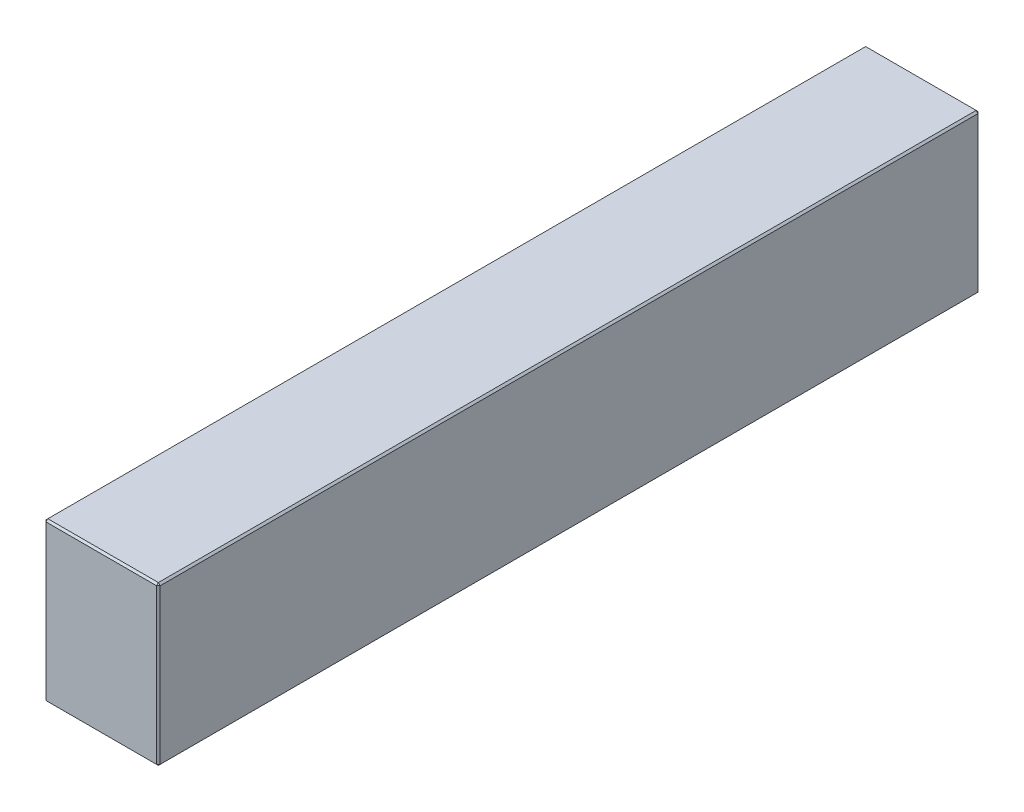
ISO-10303-21;
HEADER;
FILE_DESCRIPTION(('STEP AP214'),'2;1');
FILE_NAME('part.step','',(''),(''),'','','');
FILE_SCHEMA(('AUTOMOTIVE_DESIGN { 1 0 10303 214 1 1 1 1 }'));
ENDSEC;
DATA;
#1=APPLICATION_CONTEXT('core data for automotive mechanical design processes');
#2=APPLICATION_PROTOCOL_DEFINITION('international standard','automotive_design',2000,#1);
#3=PRODUCT_CONTEXT('',#1,'mechanical');
#4=PRODUCT('Part','Part','',(#3));
#5=PRODUCT_RELATED_PRODUCT_CATEGORY('part','',(#4));
#6=PRODUCT_DEFINITION_FORMATION('','',#4);
#7=PRODUCT_DEFINITION_CONTEXT('part definition',#1,'design');
#8=PRODUCT_DEFINITION('design','',#6,#7);
#9=PRODUCT_DEFINITION_SHAPE('','',#8);
#10=(LENGTH_UNIT() NAMED_UNIT(*) SI_UNIT(.MILLI.,.METRE.));
#11=(NAMED_UNIT(*) PLANE_ANGLE_UNIT() SI_UNIT($,.RADIAN.));
#12=(NAMED_UNIT(*) SI_UNIT($,.STERADIAN.) SOLID_ANGLE_UNIT());
#13=UNCERTAINTY_MEASURE_WITH_UNIT(LENGTH_MEASURE(1.E-05),#10,'distance_accuracy_value','');
#14=(GEOMETRIC_REPRESENTATION_CONTEXT(3) GLOBAL_UNCERTAINTY_ASSIGNED_CONTEXT((#13)) GLOBAL_UNIT_ASSIGNED_CONTEXT((#10,
#11,#12)) REPRESENTATION_CONTEXT('',''));
#15=CARTESIAN_POINT('',(0.,0.,0.));
#16=DIRECTION('',(0.,0.,1.));
#17=DIRECTION('',(1.,0.,0.));
#18=AXIS2_PLACEMENT_3D('',#15,#16,#17);
#19=CARTESIAN_POINT('',(-31.,86.,223.));
#20=DIRECTION('',(1.,0.,0.));
#21=DIRECTION('',(0.,0.,-1.));
#22=AXIS2_PLACEMENT_3D('',#19,#20,#21);
#23=PLANE('',#22);
#24=DIRECTION('',(0.,-1.,0.));
#25=VECTOR('',#24,1.);
#26=CARTESIAN_POINT('',(-31.,86.,-222.));
#27=LINE('',#26,#25);
#28=CARTESIAN_POINT('',(-31.,85.,-222.));
#29=VERTEX_POINT('',#28);
#30=CARTESIAN_POINT('',(-31.,1.00000000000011,-222.));
#31=VERTEX_POINT('',#30);
#32=EDGE_CURVE('E114',#29,#31,#27,.T.);
#33=ORIENTED_EDGE('',*,*,#32,.T.);
#34=DIRECTION('',(0.,0.,1.));
#35=VECTOR('',#34,1.);
#36=CARTESIAN_POINT('',(-31.,1.00000000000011,223.));
#37=LINE('',#36,#35);
#38=CARTESIAN_POINT('',(-31.,1.00000000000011,222.));
#39=VERTEX_POINT('',#38);
#40=EDGE_CURVE('E110',#31,#39,#37,.T.);
#41=ORIENTED_EDGE('',*,*,#40,.T.);
#42=DIRECTION('',(0.,1.,0.));
#43=VECTOR('',#42,1.);
#44=CARTESIAN_POINT('',(-31.,86.,222.));
#45=LINE('',#44,#43);
#46=CARTESIAN_POINT('',(-31.,85.,222.));
#47=VERTEX_POINT('',#46);
#48=EDGE_CURVE('E103',#39,#47,#45,.T.);
#49=ORIENTED_EDGE('',*,*,#48,.T.);
#50=DIRECTION('',(0.,0.,-1.));
#51=VECTOR('',#50,1.);
#52=CARTESIAN_POINT('',(-31.,85.,-223.));
#53=LINE('',#52,#51);
#54=EDGE_CURVE('E107',#47,#29,#53,.T.);
#55=ORIENTED_EDGE('',*,*,#54,.T.);
#56=EDGE_LOOP('',(#33,#41,#49,#55));
#57=FACE_BOUND('',#56,.T.);
#58=ADVANCED_FACE('F15',(#57),#23,.F.);
#59=CARTESIAN_POINT('',(31.,86.,223.));
#60=DIRECTION('',(0.,0.,-1.));
#61=DIRECTION('',(-1.,0.,0.));
#62=AXIS2_PLACEMENT_3D('',#59,#60,#61);
#63=PLANE('',#62);
#64=DIRECTION('',(-1.,0.,0.));
#65=VECTOR('',#64,1.);
#66=CARTESIAN_POINT('',(-31.,85.,223.));
#67=LINE('',#66,#65);
#68=CARTESIAN_POINT('',(30.,85.,223.));
#69=VERTEX_POINT('',#68);
#70=CARTESIAN_POINT('',(-30.,85.,223.));
#71=VERTEX_POINT('',#70);
#72=EDGE_CURVE('E164',#69,#71,#67,.T.);
#73=ORIENTED_EDGE('',*,*,#72,.T.);
#74=DIRECTION('',(0.,-1.,0.));
#75=VECTOR('',#74,1.);
#76=CARTESIAN_POINT('',(-30.,86.,223.));
#77=LINE('',#76,#75);
#78=CARTESIAN_POINT('',(-30.,1.00000000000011,223.));
#79=VERTEX_POINT('',#78);
#80=EDGE_CURVE('E122',#71,#79,#77,.T.);
#81=ORIENTED_EDGE('',*,*,#80,.T.);
#82=DIRECTION('',(1.,0.,0.));
#83=VECTOR('',#82,1.);
#84=CARTESIAN_POINT('',(31.,1.00000000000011,223.));
#85=LINE('',#84,#83);
#86=CARTESIAN_POINT('',(30.,1.00000000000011,223.));
#87=VERTEX_POINT('',#86);
#88=EDGE_CURVE('E168',#79,#87,#85,.T.);
#89=ORIENTED_EDGE('',*,*,#88,.T.);
#90=DIRECTION('',(0.,1.,0.));
#91=VECTOR('',#90,1.);
#92=CARTESIAN_POINT('',(30.,86.,223.));
#93=LINE('',#92,#91);
#94=EDGE_CURVE('E166',#87,#69,#93,.T.);
#95=ORIENTED_EDGE('',*,*,#94,.T.);
#96=EDGE_LOOP('',(#73,#81,#89,#95));
#97=FACE_BOUND('',#96,.T.);
#98=ADVANCED_FACE('F275',(#97),#63,.F.);
#99=CARTESIAN_POINT('',(31.,86.,223.));
#100=DIRECTION('',(-1.,0.,0.));
#101=DIRECTION('',(0.,0.,1.));
#102=AXIS2_PLACEMENT_3D('',#99,#100,#101);
#103=PLANE('',#102);
#104=DIRECTION('',(0.,0.,-1.));
#105=VECTOR('',#104,1.);
#106=CARTESIAN_POINT('',(31.,1.00000000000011,223.));
#107=LINE('',#106,#105);
#108=CARTESIAN_POINT('',(31.,1.00000000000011,222.));
#109=VERTEX_POINT('',#108);
#110=CARTESIAN_POINT('',(31.,1.00000000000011,-222.));
#111=VERTEX_POINT('',#110);
#112=EDGE_CURVE('E159',#109,#111,#107,.T.);
#113=ORIENTED_EDGE('',*,*,#112,.T.);
#114=DIRECTION('',(0.,1.,0.));
#115=VECTOR('',#114,1.);
#116=CARTESIAN_POINT('',(31.,86.,-222.));
#117=LINE('',#116,#115);
#118=CARTESIAN_POINT('',(31.,85.,-222.));
#119=VERTEX_POINT('',#118);
#120=EDGE_CURVE('E161',#111,#119,#117,.T.);
#121=ORIENTED_EDGE('',*,*,#120,.T.);
#122=DIRECTION('',(0.,0.,1.));
#123=VECTOR('',#122,1.);
#124=CARTESIAN_POINT('',(31.,85.,223.));
#125=LINE('',#124,#123);
#126=CARTESIAN_POINT('',(31.,85.,222.));
#127=VERTEX_POINT('',#126);
#128=EDGE_CURVE('E155',#119,#127,#125,.T.);
#129=ORIENTED_EDGE('',*,*,#128,.T.);
#130=DIRECTION('',(0.,-1.,0.));
#131=VECTOR('',#130,1.);
#132=CARTESIAN_POINT('',(31.,86.,222.));
#133=LINE('',#132,#131);
#134=EDGE_CURVE('E157',#127,#109,#133,.T.);
#135=ORIENTED_EDGE('',*,*,#134,.T.);
#136=EDGE_LOOP('',(#113,#121,#129,#135));
#137=FACE_BOUND('',#136,.T.);
#138=ADVANCED_FACE('F254',(#137),#103,.F.);
#139=CARTESIAN_POINT('',(31.,86.,-223.));
#140=DIRECTION('',(0.,0.,1.));
#141=DIRECTION('',(1.,0.,0.));
#142=AXIS2_PLACEMENT_3D('',#139,#140,#141);
#143=PLANE('',#142);
#144=DIRECTION('',(0.,-1.,0.));
#145=VECTOR('',#144,1.);
#146=CARTESIAN_POINT('',(30.,86.,-223.));
#147=LINE('',#146,#145);
#148=CARTESIAN_POINT('',(30.,85.,-223.));
#149=VERTEX_POINT('',#148);
#150=CARTESIAN_POINT('',(30.,1.00000000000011,-223.));
#151=VERTEX_POINT('',#150);
#152=EDGE_CURVE('E148',#149,#151,#147,.T.);
#153=ORIENTED_EDGE('',*,*,#152,.T.);
#154=DIRECTION('',(-1.,0.,0.));
#155=VECTOR('',#154,1.);
#156=CARTESIAN_POINT('',(31.,1.00000000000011,-223.));
#157=LINE('',#156,#155);
#158=CARTESIAN_POINT('',(-30.,1.00000000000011,-223.));
#159=VERTEX_POINT('',#158);
#160=EDGE_CURVE('E153',#151,#159,#157,.T.);
#161=ORIENTED_EDGE('',*,*,#160,.T.);
#162=DIRECTION('',(0.,1.,0.));
#163=VECTOR('',#162,1.);
#164=CARTESIAN_POINT('',(-30.,86.,-223.));
#165=LINE('',#164,#163);
#166=CARTESIAN_POINT('',(-30.,85.,-223.));
#167=VERTEX_POINT('',#166);
#168=EDGE_CURVE('E150',#159,#167,#165,.T.);
#169=ORIENTED_EDGE('',*,*,#168,.T.);
#170=DIRECTION('',(1.,0.,0.));
#171=VECTOR('',#170,1.);
#172=CARTESIAN_POINT('',(31.,85.,-223.));
#173=LINE('',#172,#171);
#174=EDGE_CURVE('E146',#167,#149,#173,.T.);
#175=ORIENTED_EDGE('',*,*,#174,.T.);
#176=EDGE_LOOP('',(#153,#161,#169,#175));
#177=FACE_BOUND('',#176,.T.);
#178=ADVANCED_FACE('F284',(#177),#143,.F.);
#179=CARTESIAN_POINT('',(0.,86.,0.));
#180=DIRECTION('',(0.,1.,0.));
#181=DIRECTION('',(0.,0.,1.));
#182=AXIS2_PLACEMENT_3D('',#179,#180,#181);
#183=PLANE('',#182);
#184=DIRECTION('',(0.,0.,-1.));
#185=VECTOR('',#184,1.);
#186=CARTESIAN_POINT('',(30.,86.,-223.));
#187=LINE('',#186,#185);
#188=CARTESIAN_POINT('',(30.,86.,222.));
#189=VERTEX_POINT('',#188);
#190=CARTESIAN_POINT('',(30.,86.,-222.));
#191=VERTEX_POINT('',#190);
#192=EDGE_CURVE('E24',#189,#191,#187,.T.);
#193=ORIENTED_EDGE('',*,*,#192,.T.);
#194=DIRECTION('',(-1.,0.,0.));
#195=VECTOR('',#194,1.);
#196=CARTESIAN_POINT('',(-31.,86.,-222.));
#197=LINE('',#196,#195);
#198=CARTESIAN_POINT('',(-30.,86.,-222.));
#199=VERTEX_POINT('',#198);
#200=EDGE_CURVE('E9',#191,#199,#197,.T.);
#201=ORIENTED_EDGE('',*,*,#200,.T.);
#202=DIRECTION('',(0.,0.,1.));
#203=VECTOR('',#202,1.);
#204=CARTESIAN_POINT('',(-30.,86.,223.));
#205=LINE('',#204,#203);
#206=CARTESIAN_POINT('',(-30.,86.,222.));
#207=VERTEX_POINT('',#206);
#208=EDGE_CURVE('E180',#199,#207,#205,.T.);
#209=ORIENTED_EDGE('',*,*,#208,.T.);
#210=DIRECTION('',(1.,0.,0.));
#211=VECTOR('',#210,1.);
#212=CARTESIAN_POINT('',(31.,86.,222.));
#213=LINE('',#212,#211);
#214=EDGE_CURVE('E35',#207,#189,#213,.T.);
#215=ORIENTED_EDGE('',*,*,#214,.T.);
#216=EDGE_LOOP('',(#193,#201,#209,#215));
#217=FACE_BOUND('',#216,.T.);
#218=ADVANCED_FACE('F350',(#217),#183,.T.);
#219=CARTESIAN_POINT('',(0.,0.,0.));
#220=DIRECTION('',(0.,1.,0.));
#221=DIRECTION('',(0.,0.,1.));
#222=AXIS2_PLACEMENT_3D('',#219,#220,#221);
#223=PLANE('',#222);
#224=DIRECTION('',(0.,0.,1.));
#225=VECTOR('',#224,1.);
#226=CARTESIAN_POINT('',(30.,0.,0.));
#227=LINE('',#226,#225);
#228=CARTESIAN_POINT('',(30.,0.,-222.));
#229=VERTEX_POINT('',#228);
#230=CARTESIAN_POINT('',(30.,0.,222.));
#231=VERTEX_POINT('',#230);
#232=EDGE_CURVE('E171',#229,#231,#227,.T.);
#233=ORIENTED_EDGE('',*,*,#232,.T.);
#234=DIRECTION('',(-1.,0.,0.));
#235=VECTOR('',#234,1.);
#236=CARTESIAN_POINT('',(0.,0.,222.));
#237=LINE('',#236,#235);
#238=CARTESIAN_POINT('',(-30.,0.,222.));
#239=VERTEX_POINT('',#238);
#240=EDGE_CURVE('E177',#231,#239,#237,.T.);
#241=ORIENTED_EDGE('',*,*,#240,.T.);
#242=DIRECTION('',(0.,0.,-1.));
#243=VECTOR('',#242,1.);
#244=CARTESIAN_POINT('',(-30.,0.,0.));
#245=LINE('',#244,#243);
#246=CARTESIAN_POINT('',(-30.,0.,-222.));
#247=VERTEX_POINT('',#246);
#248=EDGE_CURVE('E175',#239,#247,#245,.T.);
#249=ORIENTED_EDGE('',*,*,#248,.T.);
#250=DIRECTION('',(1.,0.,0.));
#251=VECTOR('',#250,1.);
#252=CARTESIAN_POINT('',(0.,0.,-222.));
#253=LINE('',#252,#251);
#254=EDGE_CURVE('E173',#247,#229,#253,.T.);
#255=ORIENTED_EDGE('',*,*,#254,.T.);
#256=EDGE_LOOP('',(#233,#241,#249,#255));
#257=FACE_BOUND('',#256,.T.);
#258=ADVANCED_FACE('F246',(#257),#223,.F.);
#259=CARTESIAN_POINT('',(31.,86.,222.));
#260=DIRECTION('',(-0.707106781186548,0.,-0.707106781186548));
#261=DIRECTION('',(0.,-1.,0.));
#262=AXIS2_PLACEMENT_3D('',#259,#260,#261);
#263=PLANE('',#262);
#264=DIRECTION('',(-0.707106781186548,0.,0.707106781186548));
#265=VECTOR('',#264,1.);
#266=CARTESIAN_POINT('',(30.,85.,223.));
#267=LINE('',#266,#265);
#268=EDGE_CURVE('E19',#69,#127,#267,.F.);
#269=ORIENTED_EDGE('',*,*,#268,.F.);
#270=ORIENTED_EDGE('',*,*,#94,.F.);
#271=DIRECTION('',(0.707106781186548,0.,-0.707106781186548));
#272=VECTOR('',#271,1.);
#273=CARTESIAN_POINT('',(30.,1.00000000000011,223.));
#274=LINE('',#273,#272);
#275=EDGE_CURVE('E142',#109,#87,#274,.F.);
#276=ORIENTED_EDGE('',*,*,#275,.F.);
#277=ORIENTED_EDGE('',*,*,#134,.F.);
#278=EDGE_LOOP('',(#269,#270,#276,#277));
#279=FACE_BOUND('',#278,.T.);
#280=ADVANCED_FACE('F17',(#279),#263,.F.);
#281=CARTESIAN_POINT('',(30.,85.,223.));
#282=DIRECTION('',(0.577350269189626,0.577350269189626,0.577350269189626));
#283=DIRECTION('',(0.707106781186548,0.,-0.707106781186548));
#284=AXIS2_PLACEMENT_3D('',#281,#282,#283);
#285=PLANE('',#284);
#286=DIRECTION('',(0.,-0.707106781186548,0.707106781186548));
#287=VECTOR('',#286,1.);
#288=CARTESIAN_POINT('',(30.,85.,223.));
#289=LINE('',#288,#287);
#290=EDGE_CURVE('E226',#69,#189,#289,.F.);
#291=ORIENTED_EDGE('',*,*,#290,.F.);
#292=ORIENTED_EDGE('',*,*,#268,.T.);
#293=DIRECTION('',(-0.707106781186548,0.707106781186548,0.));
#294=VECTOR('',#293,1.);
#295=CARTESIAN_POINT('',(30.5,85.5,222.));
#296=LINE('',#295,#294);
#297=EDGE_CURVE('E228',#189,#127,#296,.F.);
#298=ORIENTED_EDGE('',*,*,#297,.F.);
#299=EDGE_LOOP('',(#291,#292,#298));
#300=FACE_BOUND('',#299,.T.);
#301=ADVANCED_FACE('F270',(#300),#285,.T.);
#302=CARTESIAN_POINT('',(30.,1.00000000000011,223.));
#303=DIRECTION('',(0.577350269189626,-0.577350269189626,0.577350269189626));
#304=DIRECTION('',(0.707106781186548,0.,-0.707106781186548));
#305=AXIS2_PLACEMENT_3D('',#302,#303,#304);
#306=PLANE('',#305);
#307=DIRECTION('',(-0.707106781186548,-0.707106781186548,0.));
#308=VECTOR('',#307,1.);
#309=CARTESIAN_POINT('',(30.5,0.500000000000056,222.));
#310=LINE('',#309,#308);
#311=EDGE_CURVE('E220',#109,#231,#310,.T.);
#312=ORIENTED_EDGE('',*,*,#311,.F.);
#313=ORIENTED_EDGE('',*,*,#275,.T.);
#314=DIRECTION('',(0.,0.707106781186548,0.707106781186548));
#315=VECTOR('',#314,1.);
#316=CARTESIAN_POINT('',(30.,1.00000000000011,223.));
#317=LINE('',#316,#315);
#318=EDGE_CURVE('E223',#231,#87,#317,.T.);
#319=ORIENTED_EDGE('',*,*,#318,.F.);
#320=EDGE_LOOP('',(#312,#313,#319));
#321=FACE_BOUND('',#320,.T.);
#322=ADVANCED_FACE('F235',(#321),#306,.T.);
#323=CARTESIAN_POINT('',(30.,86.,0.));
#324=DIRECTION('',(0.707106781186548,0.707106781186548,0.));
#325=DIRECTION('',(0.,0.,1.));
#326=AXIS2_PLACEMENT_3D('',#323,#324,#325);
#327=PLANE('',#326);
#328=ORIENTED_EDGE('',*,*,#297,.T.);
#329=ORIENTED_EDGE('',*,*,#128,.F.);
#330=DIRECTION('',(0.707106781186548,-0.707106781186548,0.));
#331=VECTOR('',#330,1.);
#332=CARTESIAN_POINT('',(31.,85.,-222.));
#333=LINE('',#332,#331);
#334=EDGE_CURVE('E215',#191,#119,#333,.T.);
#335=ORIENTED_EDGE('',*,*,#334,.F.);
#336=ORIENTED_EDGE('',*,*,#192,.F.);
#337=EDGE_LOOP('',(#328,#329,#335,#336));
#338=FACE_BOUND('',#337,.T.);
#339=ADVANCED_FACE('F265',(#338),#327,.T.);
#340=CARTESIAN_POINT('',(0.,86.,222.));
#341=DIRECTION('',(0.,0.707106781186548,0.707106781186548));
#342=DIRECTION('',(-1.,0.,0.));
#343=AXIS2_PLACEMENT_3D('',#340,#341,#342);
#344=PLANE('',#343);
#345=ORIENTED_EDGE('',*,*,#290,.T.);
#346=ORIENTED_EDGE('',*,*,#214,.F.);
#347=DIRECTION('',(0.,0.707106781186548,-0.707106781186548));
#348=VECTOR('',#347,1.);
#349=CARTESIAN_POINT('',(-30.,85.5,222.5));
#350=LINE('',#349,#348);
#351=EDGE_CURVE('E126',#71,#207,#350,.T.);
#352=ORIENTED_EDGE('',*,*,#351,.F.);
#353=ORIENTED_EDGE('',*,*,#72,.F.);
#354=EDGE_LOOP('',(#345,#346,#352,#353));
#355=FACE_BOUND('',#354,.T.);
#356=ADVANCED_FACE('F273',(#355),#344,.T.);
#357=CARTESIAN_POINT('',(-30.,86.,223.));
#358=DIRECTION('',(0.707106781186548,0.,-0.707106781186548));
#359=DIRECTION('',(0.,-1.,0.));
#360=AXIS2_PLACEMENT_3D('',#357,#358,#359);
#361=PLANE('',#360);
#362=DIRECTION('',(0.707106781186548,0.,0.707106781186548));
#363=VECTOR('',#362,1.);
#364=CARTESIAN_POINT('',(-30.,1.00000000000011,223.));
#365=LINE('',#364,#363);
#366=EDGE_CURVE('E127',#79,#39,#365,.F.);
#367=ORIENTED_EDGE('',*,*,#366,.F.);
#368=ORIENTED_EDGE('',*,*,#80,.F.);
#369=DIRECTION('',(-0.707106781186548,0.,-0.707106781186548));
#370=VECTOR('',#369,1.);
#371=CARTESIAN_POINT('',(-31.,85.,222.));
#372=LINE('',#371,#370);
#373=EDGE_CURVE('E118',#47,#71,#372,.F.);
#374=ORIENTED_EDGE('',*,*,#373,.F.);
#375=ORIENTED_EDGE('',*,*,#48,.F.);
#376=EDGE_LOOP('',(#367,#368,#374,#375));
#377=FACE_BOUND('',#376,.T.);
#378=ADVANCED_FACE('F120',(#377),#361,.F.);
#379=CARTESIAN_POINT('',(31.,1.00000000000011,223.));
#380=DIRECTION('',(0.,0.707106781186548,-0.707106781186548));
#381=DIRECTION('',(1.,0.,0.));
#382=AXIS2_PLACEMENT_3D('',#379,#380,#381);
#383=PLANE('',#382);
#384=ORIENTED_EDGE('',*,*,#318,.T.);
#385=ORIENTED_EDGE('',*,*,#88,.F.);
#386=DIRECTION('',(0.,-0.707106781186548,-0.707106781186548));
#387=VECTOR('',#386,1.);
#388=CARTESIAN_POINT('',(-30.,1.00000000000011,223.));
#389=LINE('',#388,#387);
#390=EDGE_CURVE('E211',#239,#79,#389,.F.);
#391=ORIENTED_EDGE('',*,*,#390,.F.);
#392=ORIENTED_EDGE('',*,*,#240,.F.);
#393=EDGE_LOOP('',(#384,#385,#391,#392));
#394=FACE_BOUND('',#393,.T.);
#395=ADVANCED_FACE('F243',(#394),#383,.F.);
#396=CARTESIAN_POINT('',(31.,1.00000000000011,223.));
#397=DIRECTION('',(-0.707106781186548,0.707106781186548,0.));
#398=DIRECTION('',(0.,0.,-1.));
#399=AXIS2_PLACEMENT_3D('',#396,#397,#398);
#400=PLANE('',#399);
#401=ORIENTED_EDGE('',*,*,#311,.T.);
#402=ORIENTED_EDGE('',*,*,#232,.F.);
#403=DIRECTION('',(0.707106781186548,0.707106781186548,0.));
#404=VECTOR('',#403,1.);
#405=CARTESIAN_POINT('',(30.5,0.500000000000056,-222.));
#406=LINE('',#405,#404);
#407=EDGE_CURVE('E208',#111,#229,#406,.F.);
#408=ORIENTED_EDGE('',*,*,#407,.F.);
#409=ORIENTED_EDGE('',*,*,#112,.F.);
#410=EDGE_LOOP('',(#401,#402,#408,#409));
#411=FACE_BOUND('',#410,.T.);
#412=ADVANCED_FACE('F251',(#411),#400,.F.);
#413=CARTESIAN_POINT('',(30.,86.,-223.));
#414=DIRECTION('',(-0.707106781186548,0.,0.707106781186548));
#415=DIRECTION('',(0.,-1.,0.));
#416=AXIS2_PLACEMENT_3D('',#413,#414,#415);
#417=PLANE('',#416);
#418=DIRECTION('',(0.707106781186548,0.,0.707106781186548));
#419=VECTOR('',#418,1.);
#420=CARTESIAN_POINT('',(31.,85.,-222.));
#421=LINE('',#420,#419);
#422=EDGE_CURVE('E217',#119,#149,#421,.F.);
#423=ORIENTED_EDGE('',*,*,#422,.F.);
#424=ORIENTED_EDGE('',*,*,#120,.F.);
#425=DIRECTION('',(-0.707106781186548,0.,-0.707106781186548));
#426=VECTOR('',#425,1.);
#427=CARTESIAN_POINT('',(30.,1.00000000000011,-223.));
#428=LINE('',#427,#426);
#429=EDGE_CURVE('E205',#151,#111,#428,.F.);
#430=ORIENTED_EDGE('',*,*,#429,.F.);
#431=ORIENTED_EDGE('',*,*,#152,.F.);
#432=EDGE_LOOP('',(#423,#424,#430,#431));
#433=FACE_BOUND('',#432,.T.);
#434=ADVANCED_FACE('F258',(#433),#417,.F.);
#435=CARTESIAN_POINT('',(31.,85.,-222.));
#436=DIRECTION('',(0.577350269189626,0.577350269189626,-0.577350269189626));
#437=DIRECTION('',(-0.707106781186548,0.,-0.707106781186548));
#438=AXIS2_PLACEMENT_3D('',#435,#436,#437);
#439=PLANE('',#438);
#440=ORIENTED_EDGE('',*,*,#334,.T.);
#441=ORIENTED_EDGE('',*,*,#422,.T.);
#442=DIRECTION('',(0.,0.707106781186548,0.707106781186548));
#443=VECTOR('',#442,1.);
#444=CARTESIAN_POINT('',(30.,85.5,-222.5));
#445=LINE('',#444,#443);
#446=EDGE_CURVE('E134',#191,#149,#445,.F.);
#447=ORIENTED_EDGE('',*,*,#446,.F.);
#448=EDGE_LOOP('',(#440,#441,#447));
#449=FACE_BOUND('',#448,.T.);
#450=ADVANCED_FACE('F325',(#449),#439,.T.);
#451=CARTESIAN_POINT('',(-31.,85.,222.));
#452=DIRECTION('',(-0.577350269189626,0.577350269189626,0.577350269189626));
#453=DIRECTION('',(0.707106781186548,0.,0.707106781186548));
#454=AXIS2_PLACEMENT_3D('',#451,#452,#453);
#455=PLANE('',#454);
#456=ORIENTED_EDGE('',*,*,#373,.T.);
#457=ORIENTED_EDGE('',*,*,#351,.T.);
#458=DIRECTION('',(-0.707106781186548,-0.707106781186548,0.));
#459=VECTOR('',#458,1.);
#460=CARTESIAN_POINT('',(-31.,85.,222.));
#461=LINE('',#460,#459);
#462=EDGE_CURVE('E130',#47,#207,#461,.F.);
#463=ORIENTED_EDGE('',*,*,#462,.F.);
#464=EDGE_LOOP('',(#456,#457,#463));
#465=FACE_BOUND('',#464,.T.);
#466=ADVANCED_FACE('F131',(#465),#455,.T.);
#467=CARTESIAN_POINT('',(-30.,1.00000000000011,223.));
#468=DIRECTION('',(-0.577350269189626,-0.577350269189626,0.577350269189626));
#469=DIRECTION('',(0.707106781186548,0.,0.707106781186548));
#470=AXIS2_PLACEMENT_3D('',#467,#468,#469);
#471=PLANE('',#470);
#472=ORIENTED_EDGE('',*,*,#390,.T.);
#473=ORIENTED_EDGE('',*,*,#366,.T.);
#474=DIRECTION('',(-0.707106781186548,0.707106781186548,0.));
#475=VECTOR('',#474,1.);
#476=CARTESIAN_POINT('',(-30.5,0.500000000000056,222.));
#477=LINE('',#476,#475);
#478=EDGE_CURVE('E135',#239,#39,#477,.T.);
#479=ORIENTED_EDGE('',*,*,#478,.F.);
#480=EDGE_LOOP('',(#472,#473,#479));
#481=FACE_BOUND('',#480,.T.);
#482=ADVANCED_FACE('F318',(#481),#471,.T.);
#483=CARTESIAN_POINT('',(30.,1.00000000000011,-223.));
#484=DIRECTION('',(0.577350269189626,-0.577350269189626,-0.577350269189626));
#485=DIRECTION('',(-0.707106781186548,0.,-0.707106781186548));
#486=AXIS2_PLACEMENT_3D('',#483,#484,#485);
#487=PLANE('',#486);
#488=ORIENTED_EDGE('',*,*,#429,.T.);
#489=ORIENTED_EDGE('',*,*,#407,.T.);
#490=DIRECTION('',(0.,-0.707106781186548,0.707106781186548));
#491=VECTOR('',#490,1.);
#492=CARTESIAN_POINT('',(30.,1.00000000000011,-223.));
#493=LINE('',#492,#491);
#494=EDGE_CURVE('E198',#151,#229,#493,.T.);
#495=ORIENTED_EDGE('',*,*,#494,.F.);
#496=EDGE_LOOP('',(#488,#489,#495));
#497=FACE_BOUND('',#496,.T.);
#498=ADVANCED_FACE('F314',(#497),#487,.T.);
#499=CARTESIAN_POINT('',(0.,86.,-222.));
#500=DIRECTION('',(0.,0.707106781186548,-0.707106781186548));
#501=DIRECTION('',(1.,0.,0.));
#502=AXIS2_PLACEMENT_3D('',#499,#500,#501);
#503=PLANE('',#502);
#504=ORIENTED_EDGE('',*,*,#446,.T.);
#505=ORIENTED_EDGE('',*,*,#174,.F.);
#506=DIRECTION('',(0.,-0.707106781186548,-0.707106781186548));
#507=VECTOR('',#506,1.);
#508=CARTESIAN_POINT('',(-30.,85.,-223.));
#509=LINE('',#508,#507);
#510=EDGE_CURVE('E195',#199,#167,#509,.T.);
#511=ORIENTED_EDGE('',*,*,#510,.F.);
#512=ORIENTED_EDGE('',*,*,#200,.F.);
#513=EDGE_LOOP('',(#504,#505,#511,#512));
#514=FACE_BOUND('',#513,.T.);
#515=ADVANCED_FACE('F311',(#514),#503,.T.);
#516=CARTESIAN_POINT('',(-30.,86.,0.));
#517=DIRECTION('',(-0.707106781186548,0.707106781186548,0.));
#518=DIRECTION('',(0.,0.,-1.));
#519=AXIS2_PLACEMENT_3D('',#516,#517,#518);
#520=PLANE('',#519);
#521=ORIENTED_EDGE('',*,*,#462,.T.);
#522=ORIENTED_EDGE('',*,*,#208,.F.);
#523=DIRECTION('',(0.707106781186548,0.707106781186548,0.));
#524=VECTOR('',#523,1.);
#525=CARTESIAN_POINT('',(-30.5,85.5,-222.));
#526=LINE('',#525,#524);
#527=EDGE_CURVE('E138',#29,#199,#526,.T.);
#528=ORIENTED_EDGE('',*,*,#527,.F.);
#529=ORIENTED_EDGE('',*,*,#54,.F.);
#530=EDGE_LOOP('',(#521,#522,#528,#529));
#531=FACE_BOUND('',#530,.T.);
#532=ADVANCED_FACE('F137',(#531),#520,.T.);
#533=CARTESIAN_POINT('',(-31.,1.00000000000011,223.));
#534=DIRECTION('',(0.707106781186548,0.707106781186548,0.));
#535=DIRECTION('',(0.,0.,1.));
#536=AXIS2_PLACEMENT_3D('',#533,#534,#535);
#537=PLANE('',#536);
#538=ORIENTED_EDGE('',*,*,#478,.T.);
#539=ORIENTED_EDGE('',*,*,#40,.F.);
#540=DIRECTION('',(0.707106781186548,-0.707106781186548,0.));
#541=VECTOR('',#540,1.);
#542=CARTESIAN_POINT('',(-31.,1.00000000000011,-222.));
#543=LINE('',#542,#541);
#544=EDGE_CURVE('E191',#247,#31,#543,.F.);
#545=ORIENTED_EDGE('',*,*,#544,.F.);
#546=ORIENTED_EDGE('',*,*,#248,.F.);
#547=EDGE_LOOP('',(#538,#539,#545,#546));
#548=FACE_BOUND('',#547,.T.);
#549=ADVANCED_FACE('F304',(#548),#537,.F.);
#550=CARTESIAN_POINT('',(31.,1.00000000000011,-223.));
#551=DIRECTION('',(0.,0.707106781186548,0.707106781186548));
#552=DIRECTION('',(-1.,0.,0.));
#553=AXIS2_PLACEMENT_3D('',#550,#551,#552);
#554=PLANE('',#553);
#555=ORIENTED_EDGE('',*,*,#494,.T.);
#556=ORIENTED_EDGE('',*,*,#254,.F.);
#557=DIRECTION('',(0.,0.707106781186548,-0.707106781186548));
#558=VECTOR('',#557,1.);
#559=CARTESIAN_POINT('',(-30.,0.500000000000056,-222.5));
#560=LINE('',#559,#558);
#561=EDGE_CURVE('E188',#159,#247,#560,.F.);
#562=ORIENTED_EDGE('',*,*,#561,.F.);
#563=ORIENTED_EDGE('',*,*,#160,.F.);
#564=EDGE_LOOP('',(#555,#556,#562,#563));
#565=FACE_BOUND('',#564,.T.);
#566=ADVANCED_FACE('F300',(#565),#554,.F.);
#567=CARTESIAN_POINT('',(-30.,85.,-223.));
#568=DIRECTION('',(-0.577350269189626,0.577350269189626,-0.577350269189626));
#569=DIRECTION('',(-0.707106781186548,0.,0.707106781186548));
#570=AXIS2_PLACEMENT_3D('',#567,#568,#569);
#571=PLANE('',#570);
#572=ORIENTED_EDGE('',*,*,#527,.T.);
#573=ORIENTED_EDGE('',*,*,#510,.T.);
#574=DIRECTION('',(0.707106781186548,0.,-0.707106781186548));
#575=VECTOR('',#574,1.);
#576=CARTESIAN_POINT('',(-30.,85.,-223.));
#577=LINE('',#576,#575);
#578=EDGE_CURVE('E186',#29,#167,#577,.T.);
#579=ORIENTED_EDGE('',*,*,#578,.F.);
#580=EDGE_LOOP('',(#572,#573,#579));
#581=FACE_BOUND('',#580,.T.);
#582=ADVANCED_FACE('F296',(#581),#571,.T.);
#583=CARTESIAN_POINT('',(-31.,1.00000000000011,-222.));
#584=DIRECTION('',(-0.577350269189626,-0.577350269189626,-0.577350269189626));
#585=DIRECTION('',(-0.707106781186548,0.,0.707106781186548));
#586=AXIS2_PLACEMENT_3D('',#583,#584,#585);
#587=PLANE('',#586);
#588=ORIENTED_EDGE('',*,*,#561,.T.);
#589=ORIENTED_EDGE('',*,*,#544,.T.);
#590=DIRECTION('',(-0.707106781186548,0.,0.707106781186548));
#591=VECTOR('',#590,1.);
#592=CARTESIAN_POINT('',(-31.,1.00000000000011,-222.));
#593=LINE('',#592,#591);
#594=EDGE_CURVE('E184',#159,#31,#593,.T.);
#595=ORIENTED_EDGE('',*,*,#594,.F.);
#596=EDGE_LOOP('',(#588,#589,#595));
#597=FACE_BOUND('',#596,.T.);
#598=ADVANCED_FACE('F292',(#597),#587,.T.);
#599=CARTESIAN_POINT('',(-31.,86.,-222.));
#600=DIRECTION('',(0.707106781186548,0.,0.707106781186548));
#601=DIRECTION('',(0.,-1.,0.));
#602=AXIS2_PLACEMENT_3D('',#599,#600,#601);
#603=PLANE('',#602);
#604=ORIENTED_EDGE('',*,*,#578,.T.);
#605=ORIENTED_EDGE('',*,*,#168,.F.);
#606=ORIENTED_EDGE('',*,*,#594,.T.);
#607=ORIENTED_EDGE('',*,*,#32,.F.);
#608=EDGE_LOOP('',(#604,#605,#606,#607));
#609=FACE_BOUND('',#608,.T.);
#610=ADVANCED_FACE('F289',(#609),#603,.F.);
#611=CLOSED_SHELL('',(#58,#98,#138,#178,#218,#258,#280,#301,#322,#339,#356,#378,#395,#412,#434,
#450,#466,#482,#498,#515,#532,#549,#566,#582,#598,#610));
#612=MANIFOLD_SOLID_BREP('B1',#611);
#613=ADVANCED_BREP_SHAPE_REPRESENTATION('',(#18,#612),#14);
#614=SHAPE_DEFINITION_REPRESENTATION(#9,#613);
ENDSEC;
END-ISO-10303-21;
